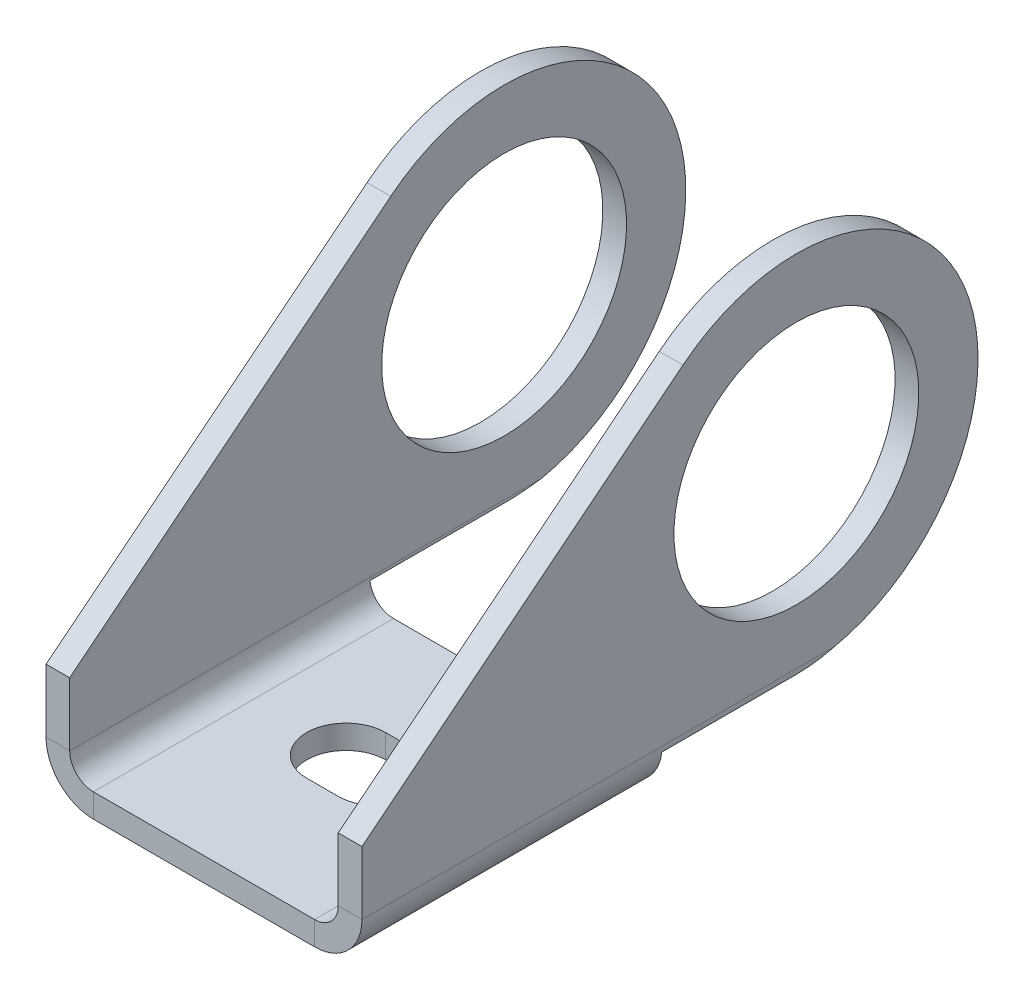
ISO-10303-21;
HEADER;
FILE_DESCRIPTION(('STEP AP214'),'2;1');
FILE_NAME('part.step','',(''),(''),'','','');
FILE_SCHEMA(('AUTOMOTIVE_DESIGN { 1 0 10303 214 1 1 1 1 }'));
ENDSEC;
DATA;
#1=APPLICATION_CONTEXT('core data for automotive mechanical design processes');
#2=APPLICATION_PROTOCOL_DEFINITION('international standard','automotive_design',2000,#1);
#3=PRODUCT_CONTEXT('',#1,'mechanical');
#4=PRODUCT('Part','Part','',(#3));
#5=PRODUCT_RELATED_PRODUCT_CATEGORY('part','',(#4));
#6=PRODUCT_DEFINITION_FORMATION('','',#4);
#7=PRODUCT_DEFINITION_CONTEXT('part definition',#1,'design');
#8=PRODUCT_DEFINITION('design','',#6,#7);
#9=PRODUCT_DEFINITION_SHAPE('','',#8);
#10=(LENGTH_UNIT() NAMED_UNIT(*) SI_UNIT(.MILLI.,.METRE.));
#11=(NAMED_UNIT(*) PLANE_ANGLE_UNIT() SI_UNIT($,.RADIAN.));
#12=(NAMED_UNIT(*) SI_UNIT($,.STERADIAN.) SOLID_ANGLE_UNIT());
#13=UNCERTAINTY_MEASURE_WITH_UNIT(LENGTH_MEASURE(1.E-05),#10,'distance_accuracy_value','');
#14=(GEOMETRIC_REPRESENTATION_CONTEXT(3) GLOBAL_UNCERTAINTY_ASSIGNED_CONTEXT((#13)) GLOBAL_UNIT_ASSIGNED_CONTEXT((#10,
#11,#12)) REPRESENTATION_CONTEXT('',''));
#15=CARTESIAN_POINT('',(0.,0.,0.));
#16=DIRECTION('',(0.,0.,1.));
#17=DIRECTION('',(1.,0.,0.));
#18=AXIS2_PLACEMENT_3D('',#15,#16,#17);
#19=CARTESIAN_POINT('',(160.601771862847,50.,78.));
#20=DIRECTION('',(0.,0.,-1.));
#21=DIRECTION('',(0.,1.,0.));
#22=AXIS2_PLACEMENT_3D('',#19,#20,#21);
#23=PLANE('',#22);
#24=DIRECTION('',(0.,-1.,0.));
#25=VECTOR('',#24,1.);
#26=CARTESIAN_POINT('',(-17.,50.,78.));
#27=LINE('',#26,#25);
#28=CARTESIAN_POINT('',(-17.,12.5,78.));
#29=VERTEX_POINT('',#28);
#30=CARTESIAN_POINT('',(-17.,4.49999999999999,78.));
#31=VERTEX_POINT('',#30);
#32=EDGE_CURVE('E50',#29,#31,#27,.T.);
#33=ORIENTED_EDGE('',*,*,#32,.F.);
#34=DIRECTION('',(1.,0.,0.));
#35=VECTOR('',#34,1.);
#36=CARTESIAN_POINT('',(-20.,12.5,78.));
#37=LINE('',#36,#35);
#38=CARTESIAN_POINT('',(-20.,12.5,78.));
#39=VERTEX_POINT('',#38);
#40=EDGE_CURVE('E531',#39,#29,#37,.T.);
#41=ORIENTED_EDGE('',*,*,#40,.F.);
#42=DIRECTION('',(0.,-1.,0.));
#43=VECTOR('',#42,1.);
#44=CARTESIAN_POINT('',(-20.,50.,78.));
#45=LINE('',#44,#43);
#46=CARTESIAN_POINT('',(-20.,4.5,78.));
#47=VERTEX_POINT('',#46);
#48=EDGE_CURVE('E57',#39,#47,#45,.T.);
#49=ORIENTED_EDGE('',*,*,#48,.T.);
#50=DIRECTION('',(-1.,0.,0.));
#51=VECTOR('',#50,1.);
#52=CARTESIAN_POINT('',(160.601771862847,4.50000000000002,78.));
#53=LINE('',#52,#51);
#54=EDGE_CURVE('E43',#31,#47,#53,.T.);
#55=ORIENTED_EDGE('',*,*,#54,.F.);
#56=EDGE_LOOP('',(#33,#41,#49,#55));
#57=FACE_BOUND('',#56,.T.);
#58=ADVANCED_FACE('F35',(#57),#23,.F.);
#59=CARTESIAN_POINT('',(-17.,50.,78.));
#60=DIRECTION('',(1.,0.,0.));
#61=DIRECTION('',(0.,1.,0.));
#62=AXIS2_PLACEMENT_3D('',#59,#60,#61);
#63=PLANE('',#62);
#64=CARTESIAN_POINT('',(-17.,27.,23.));
#65=DIRECTION('',(1.,0.,0.));
#66=DIRECTION('',(0.,-1.,0.));
#67=AXIS2_PLACEMENT_3D('',#64,#65,#66);
#68=CIRCLE('',#67,15.5);
#69=CARTESIAN_POINT('',(-17.,42.5,23.));
#70=VERTEX_POINT('',#69);
#71=EDGE_CURVE('E541',#70,#70,#68,.T.);
#72=ORIENTED_EDGE('',*,*,#71,.F.);
#73=EDGE_LOOP('',(#72));
#74=FACE_BOUND('',#73,.T.);
#75=CARTESIAN_POINT('',(-17.,27.,23.));
#76=DIRECTION('',(-1.,0.,0.));
#77=DIRECTION('',(0.,-1.,0.));
#78=AXIS2_PLACEMENT_3D('',#75,#76,#77);
#79=CIRCLE('',#78,23.);
#80=CARTESIAN_POINT('',(-17.,44.9698206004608,37.3556799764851));
#81=VERTEX_POINT('',#80);
#82=CARTESIAN_POINT('',(-17.,4.5,18.2303039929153));
#83=VERTEX_POINT('',#82);
#84=EDGE_CURVE('E539',#81,#83,#79,.T.);
#85=ORIENTED_EDGE('',*,*,#84,.F.);
#86=DIRECTION('',(0.,0.624159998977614,-0.781296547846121));
#87=VECTOR('',#86,1.);
#88=CARTESIAN_POINT('',(-17.,12.5,78.));
#89=LINE('',#88,#87);
#90=EDGE_CURVE('E519',#29,#81,#89,.T.);
#91=ORIENTED_EDGE('',*,*,#90,.F.);
#92=ORIENTED_EDGE('',*,*,#32,.T.);
#93=DIRECTION('',(0.,0.,1.));
#94=VECTOR('',#93,1.);
#95=CARTESIAN_POINT('',(-17.,4.5,0.));
#96=LINE('',#95,#94);
#97=EDGE_CURVE('E526',#83,#31,#96,.T.);
#98=ORIENTED_EDGE('',*,*,#97,.F.);
#99=EDGE_LOOP('',(#85,#91,#92,#98));
#100=FACE_BOUND('',#99,.T.);
#101=ADVANCED_FACE('F556',(#74,#100),#63,.T.);
#102=CARTESIAN_POINT('',(-20.,50.,78.));
#103=DIRECTION('',(1.,0.,0.));
#104=DIRECTION('',(0.,1.,0.));
#105=AXIS2_PLACEMENT_3D('',#102,#103,#104);
#106=PLANE('',#105);
#107=CARTESIAN_POINT('',(-20.,27.,23.));
#108=DIRECTION('',(1.,0.,0.));
#109=DIRECTION('',(0.,-1.,0.));
#110=AXIS2_PLACEMENT_3D('',#107,#108,#109);
#111=CIRCLE('',#110,15.5);
#112=CARTESIAN_POINT('',(-20.,42.5,23.));
#113=VERTEX_POINT('',#112);
#114=EDGE_CURVE('E546',#113,#113,#111,.T.);
#115=ORIENTED_EDGE('',*,*,#114,.T.);
#116=EDGE_LOOP('',(#115));
#117=FACE_BOUND('',#116,.T.);
#118=DIRECTION('',(0.,0.624159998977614,-0.781296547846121));
#119=VECTOR('',#118,1.);
#120=CARTESIAN_POINT('',(-20.,12.5,78.));
#121=LINE('',#120,#119);
#122=CARTESIAN_POINT('',(-20.,44.9698206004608,37.3556799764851));
#123=VERTEX_POINT('',#122);
#124=EDGE_CURVE('E518',#39,#123,#121,.T.);
#125=ORIENTED_EDGE('',*,*,#124,.T.);
#126=CARTESIAN_POINT('',(-20.,27.,23.));
#127=DIRECTION('',(-1.,0.,0.));
#128=DIRECTION('',(0.,-1.,0.));
#129=AXIS2_PLACEMENT_3D('',#126,#127,#128);
#130=CIRCLE('',#129,23.);
#131=CARTESIAN_POINT('',(-20.,4.5,18.2303039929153));
#132=VERTEX_POINT('',#131);
#133=EDGE_CURVE('E510',#123,#132,#130,.T.);
#134=ORIENTED_EDGE('',*,*,#133,.T.);
#135=DIRECTION('',(0.,0.,1.));
#136=VECTOR('',#135,1.);
#137=CARTESIAN_POINT('',(-20.,4.5,0.));
#138=LINE('',#137,#136);
#139=EDGE_CURVE('E521',#132,#47,#138,.T.);
#140=ORIENTED_EDGE('',*,*,#139,.T.);
#141=ORIENTED_EDGE('',*,*,#48,.F.);
#142=EDGE_LOOP('',(#125,#134,#140,#141));
#143=FACE_BOUND('',#142,.T.);
#144=ADVANCED_FACE('F502',(#117,#143),#106,.F.);
#145=CARTESIAN_POINT('',(-20.,27.,23.));
#146=DIRECTION('',(1.,0.,0.));
#147=DIRECTION('',(0.,1.,0.));
#148=AXIS2_PLACEMENT_3D('',#145,#146,#147);
#149=CYLINDRICAL_SURFACE('',#148,23.);
#150=CARTESIAN_POINT('',(-20.,4.5,18.2303039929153));
#151=CARTESIAN_POINT('',(-17.,4.5,18.2303039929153));
#152=B_SPLINE_CURVE_WITH_KNOTS('',1,(#150,#151),.UNSPECIFIED.,.F.,.F.,(2,2),(0.,1.),.UNSPECIFIED.);
#153=EDGE_CURVE('E12',#132,#83,#152,.T.);
#154=ORIENTED_EDGE('',*,*,#153,.F.);
#155=ORIENTED_EDGE('',*,*,#133,.F.);
#156=DIRECTION('',(1.,0.,0.));
#157=VECTOR('',#156,1.);
#158=CARTESIAN_POINT('',(-20.,44.9698206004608,37.3556799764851));
#159=LINE('',#158,#157);
#160=EDGE_CURVE('E528',#123,#81,#159,.T.);
#161=ORIENTED_EDGE('',*,*,#160,.T.);
#162=ORIENTED_EDGE('',*,*,#84,.T.);
#163=EDGE_LOOP('',(#154,#155,#161,#162));
#164=FACE_BOUND('',#163,.T.);
#165=ADVANCED_FACE('F497',(#164),#149,.T.);
#166=CARTESIAN_POINT('',(-20.,12.5,78.));
#167=DIRECTION('',(0.,-0.78129654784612,-0.624159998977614));
#168=DIRECTION('',(0.,0.624159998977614,-0.78129654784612));
#169=AXIS2_PLACEMENT_3D('',#166,#167,#168);
#170=PLANE('',#169);
#171=ORIENTED_EDGE('',*,*,#90,.T.);
#172=ORIENTED_EDGE('',*,*,#160,.F.);
#173=ORIENTED_EDGE('',*,*,#124,.F.);
#174=ORIENTED_EDGE('',*,*,#40,.T.);
#175=EDGE_LOOP('',(#171,#172,#173,#174));
#176=FACE_BOUND('',#175,.T.);
#177=ADVANCED_FACE('F493',(#176),#170,.F.);
#178=CARTESIAN_POINT('',(-20.,27.,23.));
#179=DIRECTION('',(1.,0.,0.));
#180=DIRECTION('',(0.,1.,0.));
#181=AXIS2_PLACEMENT_3D('',#178,#179,#180);
#182=CYLINDRICAL_SURFACE('',#181,15.5);
#183=CARTESIAN_POINT('',(-20.,42.5,23.));
#184=CARTESIAN_POINT('',(-19.96875,42.5,23.));
#185=CARTESIAN_POINT('',(-19.9375,42.5,23.));
#186=CARTESIAN_POINT('',(-19.875,42.5,23.));
#187=CARTESIAN_POINT('',(-19.84375,42.5,23.));
#188=CARTESIAN_POINT('',(-19.78125,42.5,23.));
#189=CARTESIAN_POINT('',(-19.75,42.5,23.));
#190=CARTESIAN_POINT('',(-19.6875,42.5,23.));
#191=CARTESIAN_POINT('',(-19.65625,42.5,23.));
#192=CARTESIAN_POINT('',(-19.59375,42.5,23.));
#193=CARTESIAN_POINT('',(-19.5625,42.5,23.));
#194=CARTESIAN_POINT('',(-19.5,42.5,23.));
#195=CARTESIAN_POINT('',(-19.46875,42.5,23.));
#196=CARTESIAN_POINT('',(-19.40625,42.5,23.));
#197=CARTESIAN_POINT('',(-19.375,42.5,23.));
#198=CARTESIAN_POINT('',(-19.3125,42.5,23.));
#199=CARTESIAN_POINT('',(-19.28125,42.5,23.));
#200=CARTESIAN_POINT('',(-19.21875,42.5,23.));
#201=CARTESIAN_POINT('',(-19.1875,42.5,23.));
#202=CARTESIAN_POINT('',(-19.125,42.5,23.));
#203=CARTESIAN_POINT('',(-19.09375,42.5,23.));
#204=CARTESIAN_POINT('',(-19.03125,42.5,23.));
#205=CARTESIAN_POINT('',(-19.,42.5,23.));
#206=CARTESIAN_POINT('',(-18.9375,42.5,23.));
#207=CARTESIAN_POINT('',(-18.90625,42.5,23.));
#208=CARTESIAN_POINT('',(-18.84375,42.5,23.));
#209=CARTESIAN_POINT('',(-18.8125,42.5,23.));
#210=CARTESIAN_POINT('',(-18.75,42.5,23.));
#211=CARTESIAN_POINT('',(-18.71875,42.5,23.));
#212=CARTESIAN_POINT('',(-18.65625,42.5,23.));
#213=CARTESIAN_POINT('',(-18.625,42.5,23.));
#214=CARTESIAN_POINT('',(-18.5625,42.5,23.));
#215=CARTESIAN_POINT('',(-18.53125,42.5,23.));
#216=CARTESIAN_POINT('',(-18.46875,42.5,23.));
#217=CARTESIAN_POINT('',(-18.4375,42.5,23.));
#218=CARTESIAN_POINT('',(-18.375,42.5,23.));
#219=CARTESIAN_POINT('',(-18.34375,42.5,23.));
#220=CARTESIAN_POINT('',(-18.28125,42.5,23.));
#221=CARTESIAN_POINT('',(-18.25,42.5,23.));
#222=CARTESIAN_POINT('',(-18.1875,42.5,23.));
#223=CARTESIAN_POINT('',(-18.15625,42.5,23.));
#224=CARTESIAN_POINT('',(-18.09375,42.5,23.));
#225=CARTESIAN_POINT('',(-18.0625,42.5,23.));
#226=CARTESIAN_POINT('',(-18.,42.5,23.));
#227=CARTESIAN_POINT('',(-17.96875,42.5,23.));
#228=CARTESIAN_POINT('',(-17.90625,42.5,23.));
#229=CARTESIAN_POINT('',(-17.875,42.5,23.));
#230=CARTESIAN_POINT('',(-17.8125,42.5,23.));
#231=CARTESIAN_POINT('',(-17.78125,42.5,23.));
#232=CARTESIAN_POINT('',(-17.71875,42.5,23.));
#233=CARTESIAN_POINT('',(-17.6875,42.5,23.));
#234=CARTESIAN_POINT('',(-17.625,42.5,23.));
#235=CARTESIAN_POINT('',(-17.59375,42.5,23.));
#236=CARTESIAN_POINT('',(-17.53125,42.5,23.));
#237=CARTESIAN_POINT('',(-17.5,42.5,23.));
#238=CARTESIAN_POINT('',(-17.4375,42.5,23.));
#239=CARTESIAN_POINT('',(-17.40625,42.5,23.));
#240=CARTESIAN_POINT('',(-17.34375,42.5,23.));
#241=CARTESIAN_POINT('',(-17.3125,42.5,23.));
#242=CARTESIAN_POINT('',(-17.25,42.5,23.));
#243=CARTESIAN_POINT('',(-17.21875,42.5,23.));
#244=CARTESIAN_POINT('',(-17.15625,42.5,23.));
#245=CARTESIAN_POINT('',(-17.125,42.5,23.));
#246=CARTESIAN_POINT('',(-17.0625,42.5,23.));
#247=CARTESIAN_POINT('',(-17.03125,42.5,23.));
#248=CARTESIAN_POINT('',(-17.,42.5,23.));
#249=B_SPLINE_CURVE_WITH_KNOTS('',3,(#183,#184,#185,#186,#187,#188,#189,#190,#191,#192,#193,
#194,#195,#196,#197,#198,#199,#200,#201,#202,#203,#204,#205,#206,#207,#208,#209,#210,#211,#212,
#213,#214,#215,#216,#217,#218,#219,#220,#221,#222,#223,#224,#225,#226,#227,#228,#229,#230,#231,
#232,#233,#234,#235,#236,#237,#238,#239,#240,#241,#242,#243,#244,#245,#246,#247,#248),
.UNSPECIFIED.,.F.,.F.,(4,2,2,2,2,2,2,2,2,2,2,2,2,2,2,2,2,2,2,2,2,2,2,2,2,2,2,2,2,2,2,2,4),(0.,
0.0937500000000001,0.1875,0.28125,0.375,0.46875,0.562500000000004,0.656250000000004,
0.750000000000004,0.843750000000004,0.937500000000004,1.03125,1.12500000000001,1.21875000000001,
1.31250000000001,1.40625000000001,1.50000000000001,1.59375000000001,1.68750000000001,
1.78125000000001,1.87500000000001,1.96875000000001,2.06250000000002,2.15625000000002,
2.25000000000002,2.34375000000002,2.43750000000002,2.53125000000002,2.62500000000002,
2.71875000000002,2.81250000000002,2.90625000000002,3.00000000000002),.UNSPECIFIED.);
#250=EDGE_CURVE('BSEAM489',#113,#70,#249,.T.);
#251=ORIENTED_EDGE('',*,*,#114,.F.);
#252=ORIENTED_EDGE('',*,*,#71,.T.);
#253=ORIENTED_EDGE('',*,*,#250,.T.);
#254=ORIENTED_EDGE('',*,*,#250,.F.);
#255=EDGE_LOOP('',(#251,#253,#252,#254));
#256=FACE_BOUND('',#255,.T.);
#257=ADVANCED_FACE('F489',(#256),#182,.F.);
#258=CARTESIAN_POINT('',(-160.601771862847,0.,78.));
#259=DIRECTION('',(0.,0.,-1.));
#260=DIRECTION('',(0.,-1.,0.));
#261=AXIS2_PLACEMENT_3D('',#258,#259,#260);
#262=PLANE('',#261);
#263=DIRECTION('',(0.,1.,0.));
#264=VECTOR('',#263,1.);
#265=CARTESIAN_POINT('',(20.,0.,78.));
#266=LINE('',#265,#264);
#267=CARTESIAN_POINT('',(20.,4.50000000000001,78.));
#268=VERTEX_POINT('',#267);
#269=CARTESIAN_POINT('',(20.,12.5,78.));
#270=VERTEX_POINT('',#269);
#271=EDGE_CURVE('E436',#268,#270,#266,.T.);
#272=ORIENTED_EDGE('',*,*,#271,.T.);
#273=DIRECTION('',(-1.,0.,0.));
#274=VECTOR('',#273,1.);
#275=CARTESIAN_POINT('',(20.,12.5,78.));
#276=LINE('',#275,#274);
#277=CARTESIAN_POINT('',(17.,12.5,78.));
#278=VERTEX_POINT('',#277);
#279=EDGE_CURVE('E433',#270,#278,#276,.T.);
#280=ORIENTED_EDGE('',*,*,#279,.T.);
#281=DIRECTION('',(0.,1.,0.));
#282=VECTOR('',#281,1.);
#283=CARTESIAN_POINT('',(17.,0.,78.));
#284=LINE('',#283,#282);
#285=CARTESIAN_POINT('',(17.,4.49999999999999,78.));
#286=VERTEX_POINT('',#285);
#287=EDGE_CURVE('E442',#286,#278,#284,.T.);
#288=ORIENTED_EDGE('',*,*,#287,.F.);
#289=DIRECTION('',(1.,0.,0.));
#290=VECTOR('',#289,1.);
#291=CARTESIAN_POINT('',(-160.601771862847,4.49999999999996,78.));
#292=LINE('',#291,#290);
#293=EDGE_CURVE('E446',#286,#268,#292,.T.);
#294=ORIENTED_EDGE('',*,*,#293,.T.);
#295=EDGE_LOOP('',(#272,#280,#288,#294));
#296=FACE_BOUND('',#295,.T.);
#297=ADVANCED_FACE('F485',(#296),#262,.F.);
#298=CARTESIAN_POINT('',(17.,0.,78.));
#299=DIRECTION('',(-1.,0.,0.));
#300=DIRECTION('',(0.,-1.,0.));
#301=AXIS2_PLACEMENT_3D('',#298,#299,#300);
#302=PLANE('',#301);
#303=CARTESIAN_POINT('',(17.,27.,23.));
#304=DIRECTION('',(-1.,0.,0.));
#305=DIRECTION('',(0.,-1.,0.));
#306=AXIS2_PLACEMENT_3D('',#303,#304,#305);
#307=CIRCLE('',#306,15.5);
#308=CARTESIAN_POINT('',(17.,11.5,23.));
#309=VERTEX_POINT('',#308);
#310=EDGE_CURVE('E422',#309,#309,#307,.T.);
#311=ORIENTED_EDGE('',*,*,#310,.F.);
#312=EDGE_LOOP('',(#311));
#313=FACE_BOUND('',#312,.T.);
#314=DIRECTION('',(0.,-0.624159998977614,0.781296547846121));
#315=VECTOR('',#314,1.);
#316=CARTESIAN_POINT('',(17.,12.5,78.));
#317=LINE('',#316,#315);
#318=CARTESIAN_POINT('',(17.,44.9698206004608,37.3556799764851));
#319=VERTEX_POINT('',#318);
#320=EDGE_CURVE('E426',#319,#278,#317,.T.);
#321=ORIENTED_EDGE('',*,*,#320,.F.);
#322=CARTESIAN_POINT('',(17.,27.,23.));
#323=DIRECTION('',(1.,0.,0.));
#324=DIRECTION('',(0.,-1.,0.));
#325=AXIS2_PLACEMENT_3D('',#322,#323,#324);
#326=CIRCLE('',#325,23.);
#327=CARTESIAN_POINT('',(17.,4.50000000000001,18.2303039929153));
#328=VERTEX_POINT('',#327);
#329=EDGE_CURVE('E425',#328,#319,#326,.T.);
#330=ORIENTED_EDGE('',*,*,#329,.F.);
#331=DIRECTION('',(0.,0.,-1.));
#332=VECTOR('',#331,1.);
#333=CARTESIAN_POINT('',(17.,4.50000000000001,78.));
#334=LINE('',#333,#332);
#335=EDGE_CURVE('E445',#286,#328,#334,.T.);
#336=ORIENTED_EDGE('',*,*,#335,.F.);
#337=ORIENTED_EDGE('',*,*,#287,.T.);
#338=EDGE_LOOP('',(#321,#330,#336,#337));
#339=FACE_BOUND('',#338,.T.);
#340=ADVANCED_FACE('F481',(#313,#339),#302,.T.);
#341=CARTESIAN_POINT('',(20.,0.,78.));
#342=DIRECTION('',(-1.,0.,0.));
#343=DIRECTION('',(0.,-1.,0.));
#344=AXIS2_PLACEMENT_3D('',#341,#342,#343);
#345=PLANE('',#344);
#346=CARTESIAN_POINT('',(20.,27.,23.));
#347=DIRECTION('',(-1.,0.,0.));
#348=DIRECTION('',(0.,-1.,0.));
#349=AXIS2_PLACEMENT_3D('',#346,#347,#348);
#350=CIRCLE('',#349,15.5);
#351=CARTESIAN_POINT('',(20.,11.5,23.));
#352=VERTEX_POINT('',#351);
#353=EDGE_CURVE('E419',#352,#352,#350,.T.);
#354=ORIENTED_EDGE('',*,*,#353,.T.);
#355=EDGE_LOOP('',(#354));
#356=FACE_BOUND('',#355,.T.);
#357=CARTESIAN_POINT('',(20.,27.,23.));
#358=DIRECTION('',(1.,0.,0.));
#359=DIRECTION('',(0.,-1.,0.));
#360=AXIS2_PLACEMENT_3D('',#357,#358,#359);
#361=CIRCLE('',#360,23.);
#362=CARTESIAN_POINT('',(20.,4.50000000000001,18.2303039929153));
#363=VERTEX_POINT('',#362);
#364=CARTESIAN_POINT('',(20.,44.9698206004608,37.3556799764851));
#365=VERTEX_POINT('',#364);
#366=EDGE_CURVE('E428',#363,#365,#361,.T.);
#367=ORIENTED_EDGE('',*,*,#366,.T.);
#368=DIRECTION('',(0.,-0.624159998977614,0.781296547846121));
#369=VECTOR('',#368,1.);
#370=CARTESIAN_POINT('',(20.,12.5,78.));
#371=LINE('',#370,#369);
#372=EDGE_CURVE('E429',#365,#270,#371,.T.);
#373=ORIENTED_EDGE('',*,*,#372,.T.);
#374=ORIENTED_EDGE('',*,*,#271,.F.);
#375=DIRECTION('',(0.,0.,-1.));
#376=VECTOR('',#375,1.);
#377=CARTESIAN_POINT('',(20.,4.50000000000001,78.));
#378=LINE('',#377,#376);
#379=EDGE_CURVE('E441',#268,#363,#378,.T.);
#380=ORIENTED_EDGE('',*,*,#379,.T.);
#381=EDGE_LOOP('',(#367,#373,#374,#380));
#382=FACE_BOUND('',#381,.T.);
#383=ADVANCED_FACE('F477',(#356,#382),#345,.F.);
#384=CARTESIAN_POINT('',(20.,27.,23.));
#385=DIRECTION('',(-1.,0.,0.));
#386=DIRECTION('',(0.,-1.,0.));
#387=AXIS2_PLACEMENT_3D('',#384,#385,#386);
#388=CYLINDRICAL_SURFACE('',#387,23.);
#389=CARTESIAN_POINT('',(17.,4.50000000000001,18.2303039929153));
#390=CARTESIAN_POINT('',(20.,4.50000000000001,18.2303039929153));
#391=B_SPLINE_CURVE_WITH_KNOTS('',1,(#389,#390),.UNSPECIFIED.,.F.,.F.,(2,2),(0.,1.),.UNSPECIFIED.);
#392=EDGE_CURVE('E449',#328,#363,#391,.T.);
#393=ORIENTED_EDGE('',*,*,#392,.F.);
#394=ORIENTED_EDGE('',*,*,#329,.T.);
#395=DIRECTION('',(-1.,0.,0.));
#396=VECTOR('',#395,1.);
#397=CARTESIAN_POINT('',(20.,44.9698206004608,37.3556799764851));
#398=LINE('',#397,#396);
#399=EDGE_CURVE('E432',#365,#319,#398,.T.);
#400=ORIENTED_EDGE('',*,*,#399,.F.);
#401=ORIENTED_EDGE('',*,*,#366,.F.);
#402=EDGE_LOOP('',(#393,#394,#400,#401));
#403=FACE_BOUND('',#402,.T.);
#404=ADVANCED_FACE('F466',(#403),#388,.T.);
#405=CARTESIAN_POINT('',(20.,12.5,78.));
#406=DIRECTION('',(0.,-0.78129654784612,-0.624159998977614));
#407=DIRECTION('',(0.,-0.624159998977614,0.78129654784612));
#408=AXIS2_PLACEMENT_3D('',#405,#406,#407);
#409=PLANE('',#408);
#410=ORIENTED_EDGE('',*,*,#320,.T.);
#411=ORIENTED_EDGE('',*,*,#279,.F.);
#412=ORIENTED_EDGE('',*,*,#372,.F.);
#413=ORIENTED_EDGE('',*,*,#399,.T.);
#414=EDGE_LOOP('',(#410,#411,#412,#413));
#415=FACE_BOUND('',#414,.T.);
#416=ADVANCED_FACE('F476',(#415),#409,.F.);
#417=CARTESIAN_POINT('',(20.,27.,23.));
#418=DIRECTION('',(-1.,0.,0.));
#419=DIRECTION('',(0.,-1.,0.));
#420=AXIS2_PLACEMENT_3D('',#417,#418,#419);
#421=CYLINDRICAL_SURFACE('',#420,15.5);
#422=CARTESIAN_POINT('',(20.,11.5,23.));
#423=CARTESIAN_POINT('',(19.96875,11.5,23.));
#424=CARTESIAN_POINT('',(19.9375,11.5,23.));
#425=CARTESIAN_POINT('',(19.875,11.5,23.));
#426=CARTESIAN_POINT('',(19.84375,11.5,23.));
#427=CARTESIAN_POINT('',(19.78125,11.5,23.));
#428=CARTESIAN_POINT('',(19.75,11.5,23.));
#429=CARTESIAN_POINT('',(19.6875,11.5,23.));
#430=CARTESIAN_POINT('',(19.65625,11.5,23.));
#431=CARTESIAN_POINT('',(19.59375,11.5,23.));
#432=CARTESIAN_POINT('',(19.5625,11.5,23.));
#433=CARTESIAN_POINT('',(19.5,11.5,23.));
#434=CARTESIAN_POINT('',(19.46875,11.5,23.));
#435=CARTESIAN_POINT('',(19.40625,11.5,23.));
#436=CARTESIAN_POINT('',(19.375,11.5,23.));
#437=CARTESIAN_POINT('',(19.3125,11.5,23.));
#438=CARTESIAN_POINT('',(19.28125,11.5,23.));
#439=CARTESIAN_POINT('',(19.21875,11.5,23.));
#440=CARTESIAN_POINT('',(19.1875,11.5,23.));
#441=CARTESIAN_POINT('',(19.125,11.5,23.));
#442=CARTESIAN_POINT('',(19.09375,11.5,23.));
#443=CARTESIAN_POINT('',(19.03125,11.5,23.));
#444=CARTESIAN_POINT('',(19.,11.5,23.));
#445=CARTESIAN_POINT('',(18.9375,11.5,23.));
#446=CARTESIAN_POINT('',(18.90625,11.5,23.));
#447=CARTESIAN_POINT('',(18.84375,11.5,23.));
#448=CARTESIAN_POINT('',(18.8125,11.5,23.));
#449=CARTESIAN_POINT('',(18.75,11.5,23.));
#450=CARTESIAN_POINT('',(18.71875,11.5,23.));
#451=CARTESIAN_POINT('',(18.65625,11.5,23.));
#452=CARTESIAN_POINT('',(18.625,11.5,23.));
#453=CARTESIAN_POINT('',(18.5625,11.5,23.));
#454=CARTESIAN_POINT('',(18.53125,11.5,23.));
#455=CARTESIAN_POINT('',(18.46875,11.5,23.));
#456=CARTESIAN_POINT('',(18.4375,11.5,23.));
#457=CARTESIAN_POINT('',(18.375,11.5,23.));
#458=CARTESIAN_POINT('',(18.34375,11.5,23.));
#459=CARTESIAN_POINT('',(18.28125,11.5,23.));
#460=CARTESIAN_POINT('',(18.25,11.5,23.));
#461=CARTESIAN_POINT('',(18.1875,11.5,23.));
#462=CARTESIAN_POINT('',(18.15625,11.5,23.));
#463=CARTESIAN_POINT('',(18.09375,11.5,23.));
#464=CARTESIAN_POINT('',(18.0625,11.5,23.));
#465=CARTESIAN_POINT('',(18.,11.5,23.));
#466=CARTESIAN_POINT('',(17.96875,11.5,23.));
#467=CARTESIAN_POINT('',(17.90625,11.5,23.));
#468=CARTESIAN_POINT('',(17.875,11.5,23.));
#469=CARTESIAN_POINT('',(17.8125,11.5,23.));
#470=CARTESIAN_POINT('',(17.78125,11.5,23.));
#471=CARTESIAN_POINT('',(17.71875,11.5,23.));
#472=CARTESIAN_POINT('',(17.6875,11.5,23.));
#473=CARTESIAN_POINT('',(17.625,11.5,23.));
#474=CARTESIAN_POINT('',(17.59375,11.5,23.));
#475=CARTESIAN_POINT('',(17.53125,11.5,23.));
#476=CARTESIAN_POINT('',(17.5,11.5,23.));
#477=CARTESIAN_POINT('',(17.4375,11.5,23.));
#478=CARTESIAN_POINT('',(17.40625,11.5,23.));
#479=CARTESIAN_POINT('',(17.34375,11.5,23.));
#480=CARTESIAN_POINT('',(17.3125,11.5,23.));
#481=CARTESIAN_POINT('',(17.25,11.5,23.));
#482=CARTESIAN_POINT('',(17.21875,11.5,23.));
#483=CARTESIAN_POINT('',(17.15625,11.5,23.));
#484=CARTESIAN_POINT('',(17.125,11.5,23.));
#485=CARTESIAN_POINT('',(17.0625,11.5,23.));
#486=CARTESIAN_POINT('',(17.03125,11.5,23.));
#487=CARTESIAN_POINT('',(17.,11.5,23.));
#488=B_SPLINE_CURVE_WITH_KNOTS('',3,(#422,#423,#424,#425,#426,#427,#428,#429,#430,#431,#432,
#433,#434,#435,#436,#437,#438,#439,#440,#441,#442,#443,#444,#445,#446,#447,#448,#449,#450,#451,
#452,#453,#454,#455,#456,#457,#458,#459,#460,#461,#462,#463,#464,#465,#466,#467,#468,#469,#470,
#471,#472,#473,#474,#475,#476,#477,#478,#479,#480,#481,#482,#483,#484,#485,#486,#487),
.UNSPECIFIED.,.F.,.F.,(4,2,2,2,2,2,2,2,2,2,2,2,2,2,2,2,2,2,2,2,2,2,2,2,2,2,2,2,2,2,2,2,4),(0.,
0.0937500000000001,0.1875,0.28125,0.375,0.46875,0.5625,0.656250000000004,0.750000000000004,
0.843750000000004,0.937500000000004,1.03125,1.125,1.21875000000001,1.31250000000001,
1.40625000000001,1.50000000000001,1.59375000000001,1.68750000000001,1.78125000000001,
1.87500000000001,1.96875000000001,2.06250000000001,2.15625000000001,2.25000000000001,
2.34375000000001,2.43750000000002,2.53125000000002,2.62500000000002,2.71875000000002,
2.81250000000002,2.90625000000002,3.00000000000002),.UNSPECIFIED.);
#489=EDGE_CURVE('BSEAM645',#352,#309,#488,.T.);
#490=ORIENTED_EDGE('',*,*,#353,.F.);
#491=ORIENTED_EDGE('',*,*,#310,.T.);
#492=ORIENTED_EDGE('',*,*,#489,.T.);
#493=ORIENTED_EDGE('',*,*,#489,.F.);
#494=EDGE_LOOP('',(#490,#492,#491,#493));
#495=FACE_BOUND('',#494,.T.);
#496=ADVANCED_FACE('F645',(#495),#421,.F.);
#497=CARTESIAN_POINT('',(20.568583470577,-1.50000000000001,40.));
#498=DIRECTION('',(0.,0.,1.));
#499=DIRECTION('',(1.,0.,0.));
#500=AXIS2_PLACEMENT_3D('',#497,#498,#499);
#501=PLANE('',#500);
#502=DIRECTION('',(1.,0.,0.));
#503=VECTOR('',#502,1.);
#504=CARTESIAN_POINT('',(20.568583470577,-1.50000000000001,40.));
#505=LINE('',#504,#503);
#506=CARTESIAN_POINT('',(-14.,-1.5,40.));
#507=VERTEX_POINT('',#506);
#508=CARTESIAN_POINT('',(14.,-1.50000000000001,40.));
#509=VERTEX_POINT('',#508);
#510=EDGE_CURVE('E387',#507,#509,#505,.T.);
#511=ORIENTED_EDGE('',*,*,#510,.F.);
#512=DIRECTION('',(0.,1.,0.));
#513=VECTOR('',#512,1.);
#514=CARTESIAN_POINT('',(-14.,-1.50000000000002,40.));
#515=LINE('',#514,#513);
#516=CARTESIAN_POINT('',(-14.,1.5,40.));
#517=VERTEX_POINT('',#516);
#518=EDGE_CURVE('E416',#507,#517,#515,.T.);
#519=ORIENTED_EDGE('',*,*,#518,.T.);
#520=DIRECTION('',(1.,0.,0.));
#521=VECTOR('',#520,1.);
#522=CARTESIAN_POINT('',(20.568583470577,1.50000000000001,40.));
#523=LINE('',#522,#521);
#524=CARTESIAN_POINT('',(14.,1.50000000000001,40.));
#525=VERTEX_POINT('',#524);
#526=EDGE_CURVE('E377',#517,#525,#523,.T.);
#527=ORIENTED_EDGE('',*,*,#526,.T.);
#528=DIRECTION('',(0.,-1.,0.));
#529=VECTOR('',#528,1.);
#530=CARTESIAN_POINT('',(14.,-1.50000000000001,40.));
#531=LINE('',#530,#529);
#532=EDGE_CURVE('E413',#525,#509,#531,.T.);
#533=ORIENTED_EDGE('',*,*,#532,.T.);
#534=EDGE_LOOP('',(#511,#519,#527,#533));
#535=FACE_BOUND('',#534,.T.);
#536=ADVANCED_FACE('F602',(#535),#501,.F.);
#537=CARTESIAN_POINT('',(-18.5,164.246794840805,78.));
#538=DIRECTION('',(0.,0.,-1.));
#539=DIRECTION('',(-1.,0.,0.));
#540=AXIS2_PLACEMENT_3D('',#537,#538,#539);
#541=PLANE('',#540);
#542=DIRECTION('',(0.,-1.,0.));
#543=VECTOR('',#542,1.);
#544=CARTESIAN_POINT('',(-14.,164.246794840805,78.));
#545=LINE('',#544,#543);
#546=CARTESIAN_POINT('',(-14.,1.5,78.));
#547=VERTEX_POINT('',#546);
#548=CARTESIAN_POINT('',(-14.,-1.5,78.));
#549=VERTEX_POINT('',#548);
#550=EDGE_CURVE('E404',#547,#549,#545,.T.);
#551=ORIENTED_EDGE('',*,*,#550,.T.);
#552=DIRECTION('',(1.,0.,0.));
#553=VECTOR('',#552,1.);
#554=CARTESIAN_POINT('',(-18.5,-1.5,78.));
#555=LINE('',#554,#553);
#556=CARTESIAN_POINT('',(14.,-1.49999999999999,78.));
#557=VERTEX_POINT('',#556);
#558=EDGE_CURVE('E390',#549,#557,#555,.T.);
#559=ORIENTED_EDGE('',*,*,#558,.T.);
#560=DIRECTION('',(0.,-1.,0.));
#561=VECTOR('',#560,1.);
#562=CARTESIAN_POINT('',(14.,164.246794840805,78.));
#563=LINE('',#562,#561);
#564=CARTESIAN_POINT('',(14.,1.50000000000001,78.));
#565=VERTEX_POINT('',#564);
#566=EDGE_CURVE('E402',#565,#557,#563,.T.);
#567=ORIENTED_EDGE('',*,*,#566,.F.);
#568=DIRECTION('',(1.,0.,0.));
#569=VECTOR('',#568,1.);
#570=CARTESIAN_POINT('',(-18.5,1.5,78.));
#571=LINE('',#570,#569);
#572=EDGE_CURVE('E396',#547,#565,#571,.T.);
#573=ORIENTED_EDGE('',*,*,#572,.F.);
#574=EDGE_LOOP('',(#551,#559,#567,#573));
#575=FACE_BOUND('',#574,.T.);
#576=ADVANCED_FACE('F615',(#575),#541,.F.);
#577=CARTESIAN_POINT('',(-18.5,1.5,78.));
#578=DIRECTION('',(0.,1.,0.));
#579=DIRECTION('',(-1.,0.,0.));
#580=AXIS2_PLACEMENT_3D('',#577,#578,#579);
#581=PLANE('',#580);
#582=CARTESIAN_POINT('',(2.,1.5,58.));
#583=DIRECTION('',(0.,1.,0.));
#584=DIRECTION('',(-1.,0.,0.));
#585=AXIS2_PLACEMENT_3D('',#582,#583,#584);
#586=CIRCLE('',#585,5.);
#587=CARTESIAN_POINT('',(2.,1.5,63.));
#588=VERTEX_POINT('',#587);
#589=CARTESIAN_POINT('',(2.,1.5,53.));
#590=VERTEX_POINT('',#589);
#591=EDGE_CURVE('E359',#588,#590,#586,.T.);
#592=ORIENTED_EDGE('',*,*,#591,.F.);
#593=DIRECTION('',(1.,0.,0.));
#594=VECTOR('',#593,1.);
#595=CARTESIAN_POINT('',(2.,1.5,63.));
#596=LINE('',#595,#594);
#597=CARTESIAN_POINT('',(-2.,1.5,63.));
#598=VERTEX_POINT('',#597);
#599=EDGE_CURVE('E374',#598,#588,#596,.T.);
#600=ORIENTED_EDGE('',*,*,#599,.F.);
#601=CARTESIAN_POINT('',(-2.,1.5,58.));
#602=DIRECTION('',(0.,1.,0.));
#603=DIRECTION('',(1.,0.,0.));
#604=AXIS2_PLACEMENT_3D('',#601,#602,#603);
#605=CIRCLE('',#604,5.);
#606=CARTESIAN_POINT('',(-2.,1.5,53.));
#607=VERTEX_POINT('',#606);
#608=EDGE_CURVE('E378',#607,#598,#605,.T.);
#609=ORIENTED_EDGE('',*,*,#608,.F.);
#610=DIRECTION('',(-1.,0.,0.));
#611=VECTOR('',#610,1.);
#612=CARTESIAN_POINT('',(2.,1.5,53.));
#613=LINE('',#612,#611);
#614=EDGE_CURVE('E381',#590,#607,#613,.T.);
#615=ORIENTED_EDGE('',*,*,#614,.F.);
#616=EDGE_LOOP('',(#592,#600,#609,#615));
#617=FACE_BOUND('',#616,.T.);
#618=ORIENTED_EDGE('',*,*,#526,.F.);
#619=DIRECTION('',(0.,0.,1.));
#620=VECTOR('',#619,1.);
#621=CARTESIAN_POINT('',(-14.,1.5,0.));
#622=LINE('',#621,#620);
#623=EDGE_CURVE('E399',#517,#547,#622,.T.);
#624=ORIENTED_EDGE('',*,*,#623,.T.);
#625=ORIENTED_EDGE('',*,*,#572,.T.);
#626=DIRECTION('',(0.,0.,-1.));
#627=VECTOR('',#626,1.);
#628=CARTESIAN_POINT('',(14.,1.5,78.));
#629=LINE('',#628,#627);
#630=EDGE_CURVE('E407',#565,#525,#629,.T.);
#631=ORIENTED_EDGE('',*,*,#630,.T.);
#632=EDGE_LOOP('',(#618,#624,#625,#631));
#633=FACE_BOUND('',#632,.T.);
#634=ADVANCED_FACE('F605',(#617,#633),#581,.T.);
#635=CARTESIAN_POINT('',(-18.5,-1.5,78.));
#636=DIRECTION('',(0.,1.,0.));
#637=DIRECTION('',(-1.,0.,0.));
#638=AXIS2_PLACEMENT_3D('',#635,#636,#637);
#639=PLANE('',#638);
#640=DIRECTION('',(1.,0.,0.));
#641=VECTOR('',#640,1.);
#642=CARTESIAN_POINT('',(2.,-1.50000000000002,63.));
#643=LINE('',#642,#641);
#644=CARTESIAN_POINT('',(-2.,-1.50000000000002,63.));
#645=VERTEX_POINT('',#644);
#646=CARTESIAN_POINT('',(2.,-1.50000000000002,63.));
#647=VERTEX_POINT('',#646);
#648=EDGE_CURVE('E356',#645,#647,#643,.T.);
#649=ORIENTED_EDGE('',*,*,#648,.T.);
#650=CARTESIAN_POINT('',(2.,-1.50000000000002,58.));
#651=DIRECTION('',(0.,1.,0.));
#652=DIRECTION('',(-1.,0.,0.));
#653=AXIS2_PLACEMENT_3D('',#650,#651,#652);
#654=CIRCLE('',#653,5.);
#655=CARTESIAN_POINT('',(2.,-1.50000000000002,53.));
#656=VERTEX_POINT('',#655);
#657=EDGE_CURVE('E352',#647,#656,#654,.T.);
#658=ORIENTED_EDGE('',*,*,#657,.T.);
#659=DIRECTION('',(-1.,0.,0.));
#660=VECTOR('',#659,1.);
#661=CARTESIAN_POINT('',(2.,-1.50000000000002,53.));
#662=LINE('',#661,#660);
#663=CARTESIAN_POINT('',(-2.,-1.5,53.));
#664=VERTEX_POINT('',#663);
#665=EDGE_CURVE('E360',#656,#664,#662,.T.);
#666=ORIENTED_EDGE('',*,*,#665,.T.);
#667=CARTESIAN_POINT('',(-2.,-1.50000000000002,58.));
#668=DIRECTION('',(0.,1.,0.));
#669=DIRECTION('',(1.,0.,0.));
#670=AXIS2_PLACEMENT_3D('',#667,#668,#669);
#671=CIRCLE('',#670,5.);
#672=EDGE_CURVE('E363',#664,#645,#671,.T.);
#673=ORIENTED_EDGE('',*,*,#672,.T.);
#674=EDGE_LOOP('',(#649,#658,#666,#673));
#675=FACE_BOUND('',#674,.T.);
#676=DIRECTION('',(0.,0.,1.));
#677=VECTOR('',#676,1.);
#678=CARTESIAN_POINT('',(-14.,-1.5,0.));
#679=LINE('',#678,#677);
#680=EDGE_CURVE('E393',#507,#549,#679,.T.);
#681=ORIENTED_EDGE('',*,*,#680,.F.);
#682=ORIENTED_EDGE('',*,*,#510,.T.);
#683=DIRECTION('',(0.,0.,-1.));
#684=VECTOR('',#683,1.);
#685=CARTESIAN_POINT('',(14.,-1.5,78.));
#686=LINE('',#685,#684);
#687=EDGE_CURVE('E410',#557,#509,#686,.T.);
#688=ORIENTED_EDGE('',*,*,#687,.F.);
#689=ORIENTED_EDGE('',*,*,#558,.F.);
#690=EDGE_LOOP('',(#681,#682,#688,#689));
#691=FACE_BOUND('',#690,.T.);
#692=ADVANCED_FACE('F619',(#675,#691),#639,.F.);
#693=CARTESIAN_POINT('',(2.,-1.50000000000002,58.));
#694=DIRECTION('',(0.,1.,0.));
#695=DIRECTION('',(-1.,0.,0.));
#696=AXIS2_PLACEMENT_3D('',#693,#694,#695);
#697=CYLINDRICAL_SURFACE('',#696,5.);
#698=ORIENTED_EDGE('',*,*,#591,.T.);
#699=DIRECTION('',(0.,1.,0.));
#700=VECTOR('',#699,1.);
#701=CARTESIAN_POINT('',(2.,-1.50000000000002,53.));
#702=LINE('',#701,#700);
#703=EDGE_CURVE('E353',#656,#590,#702,.T.);
#704=ORIENTED_EDGE('',*,*,#703,.F.);
#705=ORIENTED_EDGE('',*,*,#657,.F.);
#706=DIRECTION('',(0.,1.,0.));
#707=VECTOR('',#706,1.);
#708=CARTESIAN_POINT('',(2.,-1.50000000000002,63.));
#709=LINE('',#708,#707);
#710=EDGE_CURVE('E364',#647,#588,#709,.T.);
#711=ORIENTED_EDGE('',*,*,#710,.T.);
#712=EDGE_LOOP('',(#698,#704,#705,#711));
#713=FACE_BOUND('',#712,.T.);
#714=ADVANCED_FACE('F734',(#713),#697,.F.);
#715=CARTESIAN_POINT('',(2.,-1.50000000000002,63.));
#716=DIRECTION('',(0.,0.,1.));
#717=DIRECTION('',(1.,0.,0.));
#718=AXIS2_PLACEMENT_3D('',#715,#716,#717);
#719=PLANE('',#718);
#720=ORIENTED_EDGE('',*,*,#599,.T.);
#721=ORIENTED_EDGE('',*,*,#710,.F.);
#722=ORIENTED_EDGE('',*,*,#648,.F.);
#723=DIRECTION('',(0.,1.,0.));
#724=VECTOR('',#723,1.);
#725=CARTESIAN_POINT('',(-2.,-1.50000000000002,63.));
#726=LINE('',#725,#724);
#727=EDGE_CURVE('E361',#645,#598,#726,.T.);
#728=ORIENTED_EDGE('',*,*,#727,.T.);
#729=EDGE_LOOP('',(#720,#721,#722,#728));
#730=FACE_BOUND('',#729,.T.);
#731=ADVANCED_FACE('F744',(#730),#719,.F.);
#732=CARTESIAN_POINT('',(-2.,-1.50000000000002,58.));
#733=DIRECTION('',(0.,1.,0.));
#734=DIRECTION('',(-1.,0.,0.));
#735=AXIS2_PLACEMENT_3D('',#732,#733,#734);
#736=CYLINDRICAL_SURFACE('',#735,5.);
#737=ORIENTED_EDGE('',*,*,#608,.T.);
#738=ORIENTED_EDGE('',*,*,#727,.F.);
#739=ORIENTED_EDGE('',*,*,#672,.F.);
#740=DIRECTION('',(0.,1.,0.));
#741=VECTOR('',#740,1.);
#742=CARTESIAN_POINT('',(-2.,-1.50000000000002,53.));
#743=LINE('',#742,#741);
#744=EDGE_CURVE('E357',#664,#607,#743,.T.);
#745=ORIENTED_EDGE('',*,*,#744,.T.);
#746=EDGE_LOOP('',(#737,#738,#739,#745));
#747=FACE_BOUND('',#746,.T.);
#748=ADVANCED_FACE('F754',(#747),#736,.F.);
#749=CARTESIAN_POINT('',(2.,-1.50000000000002,53.));
#750=DIRECTION('',(0.,0.,-1.));
#751=DIRECTION('',(-1.,0.,0.));
#752=AXIS2_PLACEMENT_3D('',#749,#750,#751);
#753=PLANE('',#752);
#754=ORIENTED_EDGE('',*,*,#614,.T.);
#755=ORIENTED_EDGE('',*,*,#744,.F.);
#756=ORIENTED_EDGE('',*,*,#665,.F.);
#757=ORIENTED_EDGE('',*,*,#703,.T.);
#758=EDGE_LOOP('',(#754,#755,#756,#757));
#759=FACE_BOUND('',#758,.T.);
#760=ADVANCED_FACE('F764',(#759),#753,.F.);
#761=CARTESIAN_POINT('',(14.,4.50000000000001,40.));
#762=DIRECTION('',(0.,0.,-1.));
#763=DIRECTION('',(-1.,0.,0.));
#764=AXIS2_PLACEMENT_3D('',#761,#762,#763);
#765=PLANE('',#764);
#766=ORIENTED_EDGE('',*,*,#532,.F.);
#767=CARTESIAN_POINT('',(14.,4.50000000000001,40.));
#768=DIRECTION('',(0.,0.,-1.));
#769=DIRECTION('',(-1.,0.,0.));
#770=AXIS2_PLACEMENT_3D('',#767,#768,#769);
#771=CIRCLE('',#770,3.);
#772=CARTESIAN_POINT('',(16.9815005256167,4.16735211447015,40.));
#773=VERTEX_POINT('',#772);
#774=EDGE_CURVE('E253',#525,#773,#771,.F.);
#775=ORIENTED_EDGE('',*,*,#774,.T.);
#776=DIRECTION('',(0.993833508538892,-0.110882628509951,0.));
#777=VECTOR('',#776,1.);
#778=CARTESIAN_POINT('',(18.472250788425,4.00102817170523,40.));
#779=LINE('',#778,#777);
#780=CARTESIAN_POINT('',(19.9630010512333,3.8347042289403,40.));
#781=VERTEX_POINT('',#780);
#782=EDGE_CURVE('E345',#773,#781,#779,.T.);
#783=ORIENTED_EDGE('',*,*,#782,.T.);
#784=CARTESIAN_POINT('',(14.,4.50000000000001,40.));
#785=DIRECTION('',(0.,0.,-1.));
#786=DIRECTION('',(-1.,0.,0.));
#787=AXIS2_PLACEMENT_3D('',#784,#785,#786);
#788=CIRCLE('',#787,6.);
#789=EDGE_CURVE('E261',#509,#781,#788,.F.);
#790=ORIENTED_EDGE('',*,*,#789,.F.);
#791=EDGE_LOOP('',(#766,#775,#783,#790));
#792=FACE_BOUND('',#791,.T.);
#793=ADVANCED_FACE('F622',(#792),#765,.T.);
#794=CARTESIAN_POINT('',(18.472250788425,4.00102817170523,31.5));
#795=DIRECTION('',(-0.110882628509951,-0.993833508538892,0.));
#796=DIRECTION('',(0.,0.,-1.));
#797=AXIS2_PLACEMENT_3D('',#794,#795,#796);
#798=PLANE('',#797);
#799=ORIENTED_EDGE('',*,*,#782,.F.);
#800=DIRECTION('',(0.,0.,-1.));
#801=VECTOR('',#800,1.);
#802=CARTESIAN_POINT('',(16.9815005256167,4.16735211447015,232.332450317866));
#803=LINE('',#802,#801);
#804=CARTESIAN_POINT('',(16.9815005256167,4.16735211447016,23.));
#805=VERTEX_POINT('',#804);
#806=EDGE_CURVE('E257',#773,#805,#803,.T.);
#807=ORIENTED_EDGE('',*,*,#806,.T.);
#808=CARTESIAN_POINT('',(19.9630010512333,3.83470422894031,23.));
#809=CARTESIAN_POINT('',(16.9815005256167,4.16735211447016,23.));
#810=B_SPLINE_CURVE_WITH_KNOTS('',1,(#808,#809),.UNSPECIFIED.,.F.,.F.,(2,2),(0.,1.),.UNSPECIFIED.);
#811=CARTESIAN_POINT('',(19.9630010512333,3.8347042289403,23.));
#812=VERTEX_POINT('',#811);
#813=EDGE_CURVE('E268',#805,#812,#810,.F.);
#814=ORIENTED_EDGE('',*,*,#813,.T.);
#815=DIRECTION('',(0.,0.,-1.));
#816=VECTOR('',#815,1.);
#817=CARTESIAN_POINT('',(19.9630010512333,3.8347042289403,232.332450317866));
#818=LINE('',#817,#816);
#819=EDGE_CURVE('E265',#781,#812,#818,.T.);
#820=ORIENTED_EDGE('',*,*,#819,.F.);
#821=EDGE_LOOP('',(#799,#807,#814,#820));
#822=FACE_BOUND('',#821,.T.);
#823=ADVANCED_FACE('F295',(#822),#798,.T.);
#824=CARTESIAN_POINT('',(19.9630010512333,3.83470422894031,23.));
#825=CARTESIAN_POINT('',(19.9631028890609,3.83561699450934,22.8720614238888));
#826=CARTESIAN_POINT('',(19.9632489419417,3.83692759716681,22.7580502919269));
#827=CARTESIAN_POINT('',(19.9635331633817,3.83949038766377,22.6079247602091));
#828=CARTESIAN_POINT('',(19.9636387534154,3.8404441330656,22.5613647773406));
#829=CARTESIAN_POINT('',(19.9638131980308,3.84202399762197,22.496747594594));
#830=CARTESIAN_POINT('',(19.9638740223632,3.84257549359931,22.4760789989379));
#831=CARTESIAN_POINT('',(19.9639692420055,3.84344005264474,22.4463818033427));
#832=CARTESIAN_POINT('',(19.9640016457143,3.84373445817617,22.4367003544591));
#833=CARTESIAN_POINT('',(19.9640677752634,3.84433570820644,22.4177726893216));
#834=CARTESIAN_POINT('',(19.9640891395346,3.84453000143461,22.4117723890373));
#835=CARTESIAN_POINT('',(19.9645098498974,3.84836054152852,22.3013017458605));
#836=CARTESIAN_POINT('',(19.9649807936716,3.8526734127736,22.202195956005));
#837=CARTESIAN_POINT('',(19.9661048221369,3.86311631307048,22.0021650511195));
#838=CARTESIAN_POINT('',(19.9667730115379,3.86939085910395,21.8991493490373));
#839=CARTESIAN_POINT('',(19.9689349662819,3.89007573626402,21.5999167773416));
#840=CARTESIAN_POINT('',(19.9706963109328,3.90736042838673,21.400395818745));
#841=CARTESIAN_POINT('',(19.974676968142,3.94893627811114,21.0012887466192));
#842=CARTESIAN_POINT('',(19.9769269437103,3.9735948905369,20.7990654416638));
#843=CARTESIAN_POINT('',(19.9883750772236,4.11077974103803,19.8141579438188));
#844=CARTESIAN_POINT('',(20.,4.27709479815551,19.0235807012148));
#845=CARTESIAN_POINT('',(20.,4.50000000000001,18.2303039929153));
#846=CARTESIAN_POINT('',(16.9815005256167,4.16735211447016,23.));
#847=CARTESIAN_POINT('',(16.9815514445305,4.16780849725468,22.8720614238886));
#848=CARTESIAN_POINT('',(16.9816244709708,4.16846379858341,22.7580502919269));
#849=CARTESIAN_POINT('',(16.9817665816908,4.16974519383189,22.6079247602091));
#850=CARTESIAN_POINT('',(16.9818193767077,4.1702220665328,22.5613647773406));
#851=CARTESIAN_POINT('',(16.9819065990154,4.17101199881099,22.496747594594));
#852=CARTESIAN_POINT('',(16.9819370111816,4.17128774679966,22.4760789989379));
#853=CARTESIAN_POINT('',(16.9819846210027,4.17172002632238,22.4463818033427));
#854=CARTESIAN_POINT('',(16.9820008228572,4.17186722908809,22.4367003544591));
#855=CARTESIAN_POINT('',(16.9820338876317,4.17216785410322,22.4177726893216));
#856=CARTESIAN_POINT('',(16.9820445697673,4.17226500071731,22.4117723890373));
#857=CARTESIAN_POINT('',(16.9822549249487,4.17418027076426,22.3013017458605));
#858=CARTESIAN_POINT('',(16.9824903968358,4.17633670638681,22.202195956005));
#859=CARTESIAN_POINT('',(16.9830524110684,4.18155815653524,22.0021650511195));
#860=CARTESIAN_POINT('',(16.983386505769,4.18469542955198,21.8991493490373));
#861=CARTESIAN_POINT('',(16.9844674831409,4.19503786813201,21.5999167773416));
#862=CARTESIAN_POINT('',(16.9853481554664,4.20368021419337,21.400395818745));
#863=CARTESIAN_POINT('',(16.987338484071,4.22446813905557,21.0012887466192));
#864=CARTESIAN_POINT('',(16.9884634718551,4.23679744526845,20.7990654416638));
#865=CARTESIAN_POINT('',(16.9941875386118,4.30538987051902,19.8141579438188));
#866=CARTESIAN_POINT('',(17.,4.38854906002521,19.0235688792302));
#867=CARTESIAN_POINT('',(17.,4.50000000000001,18.2303039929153));
#868=B_SPLINE_SURFACE_WITH_KNOTS('',1,3,((#824,#825,#826,#827,#828,#829,#830,#831,#832,#833,
#834,#835,#836,#837,#838,#839,#840,#841,#842,#843,#844,#845),(#846,#847,#848,#849,#850,#851,
#852,#853,#854,#855,#856,#857,#858,#859,#860,#861,#862,#863,#864,#865,#866,#867)),.UNSPECIFIED.,
.F.,.F.,.F.,(2,2),(4,2,2,2,2,2,2,2,2,2,4),(0.,1.),(0.,0.0625,0.09375,0.109375,0.1171875,0.125,
0.1875,0.25,0.375,0.5,1.),.UNSPECIFIED.);
#869=CARTESIAN_POINT('',(16.9815005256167,4.16735211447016,23.));
#870=CARTESIAN_POINT('',(16.9815514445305,4.16780849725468,22.8720614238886));
#871=CARTESIAN_POINT('',(16.9816244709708,4.16846379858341,22.7580502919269));
#872=CARTESIAN_POINT('',(16.9817665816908,4.16974519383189,22.6079247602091));
#873=CARTESIAN_POINT('',(16.9818193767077,4.1702220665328,22.5613647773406));
#874=CARTESIAN_POINT('',(16.9819065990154,4.17101199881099,22.496747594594));
#875=CARTESIAN_POINT('',(16.9819370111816,4.17128774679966,22.4760789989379));
#876=CARTESIAN_POINT('',(16.9819846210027,4.17172002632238,22.4463818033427));
#877=CARTESIAN_POINT('',(16.9820008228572,4.17186722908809,22.4367003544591));
#878=CARTESIAN_POINT('',(16.9820338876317,4.17216785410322,22.4177726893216));
#879=CARTESIAN_POINT('',(16.9820445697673,4.17226500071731,22.4117723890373));
#880=CARTESIAN_POINT('',(16.9822549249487,4.17418027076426,22.3013017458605));
#881=CARTESIAN_POINT('',(16.9824903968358,4.17633670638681,22.202195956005));
#882=CARTESIAN_POINT('',(16.9830524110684,4.18155815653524,22.0021650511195));
#883=CARTESIAN_POINT('',(16.983386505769,4.18469542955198,21.8991493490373));
#884=CARTESIAN_POINT('',(16.9844674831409,4.19503786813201,21.5999167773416));
#885=CARTESIAN_POINT('',(16.9853481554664,4.20368021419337,21.400395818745));
#886=CARTESIAN_POINT('',(16.987338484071,4.22446813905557,21.0012887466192));
#887=CARTESIAN_POINT('',(16.9884634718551,4.23679744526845,20.7990654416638));
#888=CARTESIAN_POINT('',(16.9941875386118,4.30538987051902,19.8141579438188));
#889=CARTESIAN_POINT('',(17.,4.38854906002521,19.0235688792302));
#890=CARTESIAN_POINT('',(17.,4.50000000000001,18.2303039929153));
#891=B_SPLINE_CURVE_WITH_KNOTS('',3,(#869,#870,#871,#872,#873,#874,#875,#876,#877,#878,#879,
#880,#881,#882,#883,#884,#885,#886,#887,#888,#889,#890),.UNSPECIFIED.,.F.,.F.,(4,2,2,2,2,2,2,2,
2,2,4),(0.,0.0625,0.09375,0.109375,0.1171875,0.125,0.1875,0.25,0.375,0.5,1.),.UNSPECIFIED.);
#892=EDGE_CURVE('E187',#805,#328,#891,.T.);
#893=CARTESIAN_POINT('',(20.,4.50000000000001,18.2303039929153));
#894=CARTESIAN_POINT('',(20.,4.27709479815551,19.0235807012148));
#895=CARTESIAN_POINT('',(19.9883750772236,4.11077974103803,19.8141579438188));
#896=CARTESIAN_POINT('',(19.9769269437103,3.9735948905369,20.7990654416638));
#897=CARTESIAN_POINT('',(19.974676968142,3.94893627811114,21.0012887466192));
#898=CARTESIAN_POINT('',(19.9706963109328,3.90736042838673,21.400395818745));
#899=CARTESIAN_POINT('',(19.9689349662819,3.89007573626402,21.5999167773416));
#900=CARTESIAN_POINT('',(19.9667730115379,3.86939085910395,21.8991493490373));
#901=CARTESIAN_POINT('',(19.9661048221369,3.86311631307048,22.0021650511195));
#902=CARTESIAN_POINT('',(19.9649807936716,3.8526734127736,22.202195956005));
#903=CARTESIAN_POINT('',(19.9645098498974,3.84836054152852,22.3013017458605));
#904=CARTESIAN_POINT('',(19.9640891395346,3.84453000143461,22.4117723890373));
#905=CARTESIAN_POINT('',(19.9640677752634,3.84433570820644,22.4177726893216));
#906=CARTESIAN_POINT('',(19.9640016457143,3.84373445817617,22.4367003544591));
#907=CARTESIAN_POINT('',(19.9639692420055,3.84344005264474,22.4463818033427));
#908=CARTESIAN_POINT('',(19.9638740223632,3.84257549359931,22.4760789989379));
#909=CARTESIAN_POINT('',(19.9638131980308,3.84202399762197,22.496747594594));
#910=CARTESIAN_POINT('',(19.9636387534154,3.8404441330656,22.5613647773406));
#911=CARTESIAN_POINT('',(19.9635331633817,3.83949038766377,22.6079247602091));
#912=CARTESIAN_POINT('',(19.9632489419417,3.83692759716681,22.7580502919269));
#913=CARTESIAN_POINT('',(19.9631028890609,3.83561699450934,22.8720614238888));
#914=CARTESIAN_POINT('',(19.9630010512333,3.83470422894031,23.));
#915=B_SPLINE_CURVE_WITH_KNOTS('',3,(#893,#894,#895,#896,#897,#898,#899,#900,#901,#902,#903,
#904,#905,#906,#907,#908,#909,#910,#911,#912,#913,#914),.UNSPECIFIED.,.F.,.F.,(4,2,2,2,2,2,2,2,
2,2,4),(0.,0.5,0.625,0.75,0.8125,0.875,0.8828125,0.890625,0.90625,0.9375,1.),.UNSPECIFIED.);
#916=EDGE_CURVE('E260',#812,#363,#915,.F.);
#917=ORIENTED_EDGE('',*,*,#813,.F.);
#918=ORIENTED_EDGE('',*,*,#892,.T.);
#919=ORIENTED_EDGE('',*,*,#392,.T.);
#920=ORIENTED_EDGE('',*,*,#916,.F.);
#921=EDGE_LOOP('',(#917,#918,#919,#920));
#922=FACE_BOUND('',#921,.T.);
#923=ADVANCED_FACE('F288',(#922),#868,.T.);
#924=CARTESIAN_POINT('',(14.,4.50000000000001,78.));
#925=DIRECTION('',(0.,0.,1.));
#926=DIRECTION('',(1.,0.,0.));
#927=AXIS2_PLACEMENT_3D('',#924,#925,#926);
#928=PLANE('',#927);
#929=CARTESIAN_POINT('',(14.,4.50000000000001,78.));
#930=DIRECTION('',(0.,0.,-1.));
#931=DIRECTION('',(-1.,0.,0.));
#932=AXIS2_PLACEMENT_3D('',#929,#930,#931);
#933=CIRCLE('',#932,3.);
#934=EDGE_CURVE('E256',#286,#565,#933,.T.);
#935=ORIENTED_EDGE('',*,*,#934,.T.);
#936=ORIENTED_EDGE('',*,*,#566,.T.);
#937=CARTESIAN_POINT('',(14.,4.50000000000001,78.));
#938=DIRECTION('',(0.,0.,-1.));
#939=DIRECTION('',(-1.,0.,0.));
#940=AXIS2_PLACEMENT_3D('',#937,#938,#939);
#941=CIRCLE('',#940,6.);
#942=EDGE_CURVE('E264',#268,#557,#941,.T.);
#943=ORIENTED_EDGE('',*,*,#942,.F.);
#944=ORIENTED_EDGE('',*,*,#293,.F.);
#945=EDGE_LOOP('',(#935,#936,#943,#944));
#946=FACE_BOUND('',#945,.T.);
#947=ADVANCED_FACE('F286',(#946),#928,.T.);
#948=CARTESIAN_POINT('',(14.,4.50000000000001,232.332450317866));
#949=DIRECTION('',(0.,0.,-1.));
#950=DIRECTION('',(-1.,0.,0.));
#951=AXIS2_PLACEMENT_3D('',#948,#949,#950);
#952=CYLINDRICAL_SURFACE('',#951,6.);
#953=ORIENTED_EDGE('',*,*,#379,.F.);
#954=ORIENTED_EDGE('',*,*,#942,.T.);
#955=ORIENTED_EDGE('',*,*,#687,.T.);
#956=ORIENTED_EDGE('',*,*,#789,.T.);
#957=ORIENTED_EDGE('',*,*,#819,.T.);
#958=ORIENTED_EDGE('',*,*,#916,.T.);
#959=EDGE_LOOP('',(#953,#954,#955,#956,#957,#958));
#960=FACE_BOUND('',#959,.T.);
#961=ADVANCED_FACE('F275',(#960),#952,.T.);
#962=CARTESIAN_POINT('',(14.,4.50000000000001,232.332450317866));
#963=DIRECTION('',(0.,0.,-1.));
#964=DIRECTION('',(-1.,0.,0.));
#965=AXIS2_PLACEMENT_3D('',#962,#963,#964);
#966=CYLINDRICAL_SURFACE('',#965,3.);
#967=ORIENTED_EDGE('',*,*,#335,.T.);
#968=ORIENTED_EDGE('',*,*,#892,.F.);
#969=ORIENTED_EDGE('',*,*,#806,.F.);
#970=ORIENTED_EDGE('',*,*,#774,.F.);
#971=ORIENTED_EDGE('',*,*,#630,.F.);
#972=ORIENTED_EDGE('',*,*,#934,.F.);
#973=EDGE_LOOP('',(#967,#968,#969,#970,#971,#972));
#974=FACE_BOUND('',#973,.T.);
#975=ADVANCED_FACE('F285',(#974),#966,.F.);
#976=CARTESIAN_POINT('',(-14.,4.5,78.));
#977=DIRECTION('',(0.,0.,1.));
#978=DIRECTION('',(1.,0.,0.));
#979=AXIS2_PLACEMENT_3D('',#976,#977,#978);
#980=PLANE('',#979);
#981=ORIENTED_EDGE('',*,*,#550,.F.);
#982=CARTESIAN_POINT('',(-14.,4.5,78.));
#983=DIRECTION('',(0.,0.,1.));
#984=DIRECTION('',(1.,0.,0.));
#985=AXIS2_PLACEMENT_3D('',#982,#983,#984);
#986=CIRCLE('',#985,3.);
#987=EDGE_CURVE('E203',#547,#31,#986,.F.);
#988=ORIENTED_EDGE('',*,*,#987,.T.);
#989=ORIENTED_EDGE('',*,*,#54,.T.);
#990=CARTESIAN_POINT('',(-14.,4.5,78.));
#991=DIRECTION('',(0.,0.,1.));
#992=DIRECTION('',(1.,0.,0.));
#993=AXIS2_PLACEMENT_3D('',#990,#991,#992);
#994=CIRCLE('',#993,6.);
#995=EDGE_CURVE('E564',#549,#47,#994,.F.);
#996=ORIENTED_EDGE('',*,*,#995,.F.);
#997=EDGE_LOOP('',(#981,#988,#989,#996));
#998=FACE_BOUND('',#997,.T.);
#999=ADVANCED_FACE('F223',(#998),#980,.T.);
#1000=CARTESIAN_POINT('',(-20.,4.5,18.2303039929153));
#1001=CARTESIAN_POINT('',(-20.,4.46552109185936,18.3556113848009));
#1002=CARTESIAN_POINT('',(-19.9997073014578,4.43528624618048,18.4673527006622));
#1003=CARTESIAN_POINT('',(-19.9991179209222,4.39630301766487,18.6146157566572));
#1004=CARTESIAN_POINT('',(-19.998895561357,4.3843700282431,18.6603119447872));
#1005=CARTESIAN_POINT('',(-19.9985516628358,4.36806247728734,18.7237689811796));
#1006=CARTESIAN_POINT('',(-19.9984352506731,4.36289194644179,18.7440734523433));
#1007=CARTESIAN_POINT('',(-19.9982610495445,4.35553408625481,18.7732583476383));
#1008=CARTESIAN_POINT('',(-19.9982030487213,4.3531477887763,18.7827746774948));
#1009=CARTESIAN_POINT('',(-19.9980876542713,4.34850783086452,18.8013834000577));
#1010=CARTESIAN_POINT('',(-19.9980507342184,4.34704168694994,18.807278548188));
#1011=CARTESIAN_POINT('',(-19.9973546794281,4.32026792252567,18.9159775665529));
#1012=CARTESIAN_POINT('',(-19.9966111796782,4.29711729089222,19.0136172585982));
#1013=CARTESIAN_POINT('',(-19.9949194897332,4.2521142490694,19.2109333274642));
#1014=CARTESIAN_POINT('',(-19.993950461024,4.22983258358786,19.3126482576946));
#1015=CARTESIAN_POINT('',(-19.9909249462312,4.16751159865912,19.6086167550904));
#1016=CARTESIAN_POINT('',(-19.9886448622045,4.12940566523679,19.8065046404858));
#1017=CARTESIAN_POINT('',(-19.9839507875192,4.06006771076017,20.203431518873));
#1018=CARTESIAN_POINT('',(-19.981506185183,4.02846868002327,20.4051039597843));
#1019=CARTESIAN_POINT('',(-19.9700580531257,3.89128388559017,21.3900094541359));
#1020=CARTESIAN_POINT('',(-19.9631435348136,3.83598129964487,22.1893144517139));
#1021=CARTESIAN_POINT('',(-19.9630010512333,3.8347042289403,23.));
#1022=CARTESIAN_POINT('',(-17.,4.5,18.2303039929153));
#1023=CARTESIAN_POINT('',(-17.,4.48276055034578,18.3556113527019));
#1024=CARTESIAN_POINT('',(-16.9998536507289,4.46764312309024,18.4673527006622));
#1025=CARTESIAN_POINT('',(-16.9995589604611,4.44815150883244,18.6146157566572));
#1026=CARTESIAN_POINT('',(-16.9994477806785,4.44218501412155,18.6603119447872));
#1027=CARTESIAN_POINT('',(-16.9992758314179,4.43403123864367,18.7237689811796));
#1028=CARTESIAN_POINT('',(-16.9992176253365,4.4314459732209,18.7440734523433));
#1029=CARTESIAN_POINT('',(-16.9991305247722,4.4277670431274,18.7732583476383));
#1030=CARTESIAN_POINT('',(-16.9991015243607,4.42657389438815,18.7827746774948));
#1031=CARTESIAN_POINT('',(-16.9990438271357,4.42425391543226,18.8013834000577));
#1032=CARTESIAN_POINT('',(-16.9990253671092,4.42352084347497,18.807278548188));
#1033=CARTESIAN_POINT('',(-16.998677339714,4.41013396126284,18.9159775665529));
#1034=CARTESIAN_POINT('',(-16.9983055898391,4.39855864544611,19.0136172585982));
#1035=CARTESIAN_POINT('',(-16.9974597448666,4.3760571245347,19.2109333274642));
#1036=CARTESIAN_POINT('',(-16.996975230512,4.36491629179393,19.3126482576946));
#1037=CARTESIAN_POINT('',(-16.9954624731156,4.33375579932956,19.6086167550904));
#1038=CARTESIAN_POINT('',(-16.9943224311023,4.31470283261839,19.8065046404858));
#1039=CARTESIAN_POINT('',(-16.9919753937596,4.28003385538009,20.203431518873));
#1040=CARTESIAN_POINT('',(-16.9907530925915,4.26423434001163,20.4051039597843));
#1041=CARTESIAN_POINT('',(-16.9850290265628,4.19564194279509,21.3900094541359));
#1042=CARTESIAN_POINT('',(-16.9815717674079,4.16799064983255,22.1893144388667));
#1043=CARTESIAN_POINT('',(-16.9815005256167,4.16735211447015,23.));
#1044=B_SPLINE_SURFACE_WITH_KNOTS('',1,3,((#1000,#1001,#1002,#1003,#1004,#1005,#1006,#1007,
#1008,#1009,#1010,#1011,#1012,#1013,#1014,#1015,#1016,#1017,#1018,#1019,#1020,#1021),(#1022,
#1023,#1024,#1025,#1026,#1027,#1028,#1029,#1030,#1031,#1032,#1033,#1034,#1035,#1036,#1037,#1038,
#1039,#1040,#1041,#1042,#1043)),.UNSPECIFIED.,.F.,.F.,.F.,(2,2),(4,2,2,2,2,2,2,2,2,2,4),(0.,1.),
(0.,0.0625,0.09375,0.109375,0.1171875,0.125,0.1875,0.25,0.375,0.5,1.),.UNSPECIFIED.);
#1045=CARTESIAN_POINT('',(-17.,4.5,18.2303039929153));
#1046=CARTESIAN_POINT('',(-17.,4.48276055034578,18.3556113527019));
#1047=CARTESIAN_POINT('',(-16.9998536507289,4.46764312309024,18.4673527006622));
#1048=CARTESIAN_POINT('',(-16.9995589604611,4.44815150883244,18.6146157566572));
#1049=CARTESIAN_POINT('',(-16.9994477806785,4.44218501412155,18.6603119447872));
#1050=CARTESIAN_POINT('',(-16.9992758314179,4.43403123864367,18.7237689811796));
#1051=CARTESIAN_POINT('',(-16.9992176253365,4.4314459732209,18.7440734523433));
#1052=CARTESIAN_POINT('',(-16.9991305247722,4.4277670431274,18.7732583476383));
#1053=CARTESIAN_POINT('',(-16.9991015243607,4.42657389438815,18.7827746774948));
#1054=CARTESIAN_POINT('',(-16.9990438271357,4.42425391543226,18.8013834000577));
#1055=CARTESIAN_POINT('',(-16.9990253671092,4.42352084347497,18.807278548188));
#1056=CARTESIAN_POINT('',(-16.998677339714,4.41013396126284,18.9159775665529));
#1057=CARTESIAN_POINT('',(-16.9983055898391,4.39855864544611,19.0136172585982));
#1058=CARTESIAN_POINT('',(-16.9974597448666,4.3760571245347,19.2109333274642));
#1059=CARTESIAN_POINT('',(-16.996975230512,4.36491629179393,19.3126482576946));
#1060=CARTESIAN_POINT('',(-16.9954624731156,4.33375579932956,19.6086167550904));
#1061=CARTESIAN_POINT('',(-16.9943224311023,4.31470283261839,19.8065046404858));
#1062=CARTESIAN_POINT('',(-16.9919753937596,4.28003385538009,20.203431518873));
#1063=CARTESIAN_POINT('',(-16.9907530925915,4.26423434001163,20.4051039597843));
#1064=CARTESIAN_POINT('',(-16.9850290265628,4.19564194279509,21.3900094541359));
#1065=CARTESIAN_POINT('',(-16.9815717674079,4.16799064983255,22.1893144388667));
#1066=CARTESIAN_POINT('',(-16.9815005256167,4.16735211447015,23.));
#1067=B_SPLINE_CURVE_WITH_KNOTS('',3,(#1045,#1046,#1047,#1048,#1049,#1050,#1051,#1052,#1053,
#1054,#1055,#1056,#1057,#1058,#1059,#1060,#1061,#1062,#1063,#1064,#1065,#1066),.UNSPECIFIED.,
.F.,.F.,(4,2,2,2,2,2,2,2,2,2,4),(0.,0.0625,0.09375,0.109375,0.1171875,0.125,0.1875,0.25,0.375,
0.5,1.),.UNSPECIFIED.);
#1068=CARTESIAN_POINT('',(-16.9815005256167,4.16735211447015,23.));
#1069=VERTEX_POINT('',#1068);
#1070=EDGE_CURVE('E195',#83,#1069,#1067,.T.);
#1071=CARTESIAN_POINT('',(-16.9815005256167,4.16735211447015,23.));
#1072=CARTESIAN_POINT('',(-19.9630010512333,3.8347042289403,23.));
#1073=B_SPLINE_CURVE_WITH_KNOTS('',1,(#1071,#1072),.UNSPECIFIED.,.F.,.F.,(2,2),(0.,1.),.UNSPECIFIED.);
#1074=CARTESIAN_POINT('',(-19.9630010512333,3.8347042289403,23.));
#1075=VERTEX_POINT('',#1074);
#1076=EDGE_CURVE('E174',#1069,#1075,#1073,.T.);
#1077=CARTESIAN_POINT('',(-19.9630010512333,3.8347042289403,23.));
#1078=CARTESIAN_POINT('',(-19.9631435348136,3.83598129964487,22.1893144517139));
#1079=CARTESIAN_POINT('',(-19.9700580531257,3.89128388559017,21.3900094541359));
#1080=CARTESIAN_POINT('',(-19.981506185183,4.02846868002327,20.4051039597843));
#1081=CARTESIAN_POINT('',(-19.9839507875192,4.06006771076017,20.203431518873));
#1082=CARTESIAN_POINT('',(-19.9886448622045,4.12940566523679,19.8065046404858));
#1083=CARTESIAN_POINT('',(-19.9909249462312,4.16751159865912,19.6086167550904));
#1084=CARTESIAN_POINT('',(-19.993950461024,4.22983258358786,19.3126482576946));
#1085=CARTESIAN_POINT('',(-19.9949194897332,4.2521142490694,19.2109333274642));
#1086=CARTESIAN_POINT('',(-19.9966111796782,4.29711729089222,19.0136172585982));
#1087=CARTESIAN_POINT('',(-19.9973546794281,4.32026792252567,18.9159775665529));
#1088=CARTESIAN_POINT('',(-19.9980507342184,4.34704168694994,18.807278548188));
#1089=CARTESIAN_POINT('',(-19.9980876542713,4.34850783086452,18.8013834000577));
#1090=CARTESIAN_POINT('',(-19.9982030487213,4.3531477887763,18.7827746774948));
#1091=CARTESIAN_POINT('',(-19.9982610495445,4.35553408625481,18.7732583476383));
#1092=CARTESIAN_POINT('',(-19.9984352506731,4.36289194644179,18.7440734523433));
#1093=CARTESIAN_POINT('',(-19.9985516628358,4.36806247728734,18.7237689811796));
#1094=CARTESIAN_POINT('',(-19.998895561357,4.3843700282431,18.6603119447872));
#1095=CARTESIAN_POINT('',(-19.9991179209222,4.39630301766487,18.6146157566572));
#1096=CARTESIAN_POINT('',(-19.9997073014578,4.43528624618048,18.4673527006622));
#1097=CARTESIAN_POINT('',(-20.,4.46552109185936,18.3556113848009));
#1098=CARTESIAN_POINT('',(-20.,4.5,18.2303039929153));
#1099=B_SPLINE_CURVE_WITH_KNOTS('',3,(#1077,#1078,#1079,#1080,#1081,#1082,#1083,#1084,#1085,
#1086,#1087,#1088,#1089,#1090,#1091,#1092,#1093,#1094,#1095,#1096,#1097,#1098),.UNSPECIFIED.,
.F.,.F.,(4,2,2,2,2,2,2,2,2,2,4),(0.,0.5,0.625,0.75,0.8125,0.875,0.8828125,0.890625,0.90625,
0.9375,1.),.UNSPECIFIED.);
#1100=EDGE_CURVE('E566',#132,#1075,#1099,.F.);
#1101=ORIENTED_EDGE('',*,*,#153,.T.);
#1102=ORIENTED_EDGE('',*,*,#1070,.T.);
#1103=ORIENTED_EDGE('',*,*,#1076,.T.);
#1104=ORIENTED_EDGE('',*,*,#1100,.F.);
#1105=EDGE_LOOP('',(#1101,#1102,#1103,#1104));
#1106=FACE_BOUND('',#1105,.T.);
#1107=ADVANCED_FACE('F201',(#1106),#1044,.T.);
#1108=CARTESIAN_POINT('',(-18.472250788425,4.00102817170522,31.5));
#1109=DIRECTION('',(0.110882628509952,-0.993833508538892,0.));
#1110=DIRECTION('',(0.,0.,1.));
#1111=AXIS2_PLACEMENT_3D('',#1108,#1109,#1110);
#1112=PLANE('',#1111);
#1113=ORIENTED_EDGE('',*,*,#1076,.F.);
#1114=DIRECTION('',(0.,0.,1.));
#1115=VECTOR('',#1114,1.);
#1116=CARTESIAN_POINT('',(-16.9815005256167,4.16735211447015,-127.403622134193));
#1117=LINE('',#1116,#1115);
#1118=CARTESIAN_POINT('',(-16.9815005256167,4.16735211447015,40.));
#1119=VERTEX_POINT('',#1118);
#1120=EDGE_CURVE('E178',#1069,#1119,#1117,.T.);
#1121=ORIENTED_EDGE('',*,*,#1120,.T.);
#1122=DIRECTION('',(-0.993833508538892,-0.110882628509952,0.));
#1123=VECTOR('',#1122,1.);
#1124=CARTESIAN_POINT('',(-18.472250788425,4.00102817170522,40.));
#1125=LINE('',#1124,#1123);
#1126=CARTESIAN_POINT('',(-19.9630010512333,3.83470422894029,40.));
#1127=VERTEX_POINT('',#1126);
#1128=EDGE_CURVE('E188',#1119,#1127,#1125,.T.);
#1129=ORIENTED_EDGE('',*,*,#1128,.T.);
#1130=DIRECTION('',(0.,0.,1.));
#1131=VECTOR('',#1130,1.);
#1132=CARTESIAN_POINT('',(-19.9630010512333,3.83470422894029,-127.403622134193));
#1133=LINE('',#1132,#1131);
#1134=EDGE_CURVE('E181',#1075,#1127,#1133,.T.);
#1135=ORIENTED_EDGE('',*,*,#1134,.F.);
#1136=EDGE_LOOP('',(#1113,#1121,#1129,#1135));
#1137=FACE_BOUND('',#1136,.T.);
#1138=ADVANCED_FACE('F177',(#1137),#1112,.T.);
#1139=CARTESIAN_POINT('',(-14.,4.5,40.));
#1140=DIRECTION('',(0.,0.,-1.));
#1141=DIRECTION('',(-1.,0.,0.));
#1142=AXIS2_PLACEMENT_3D('',#1139,#1140,#1141);
#1143=PLANE('',#1142);
#1144=CARTESIAN_POINT('',(-14.,4.5,40.));
#1145=DIRECTION('',(0.,0.,1.));
#1146=DIRECTION('',(1.,0.,0.));
#1147=AXIS2_PLACEMENT_3D('',#1144,#1145,#1146);
#1148=CIRCLE('',#1147,3.);
#1149=EDGE_CURVE('E198',#1119,#517,#1148,.T.);
#1150=ORIENTED_EDGE('',*,*,#1149,.T.);
#1151=ORIENTED_EDGE('',*,*,#518,.F.);
#1152=CARTESIAN_POINT('',(-14.,4.5,40.));
#1153=DIRECTION('',(0.,0.,1.));
#1154=DIRECTION('',(1.,0.,0.));
#1155=AXIS2_PLACEMENT_3D('',#1152,#1153,#1154);
#1156=CIRCLE('',#1155,6.);
#1157=EDGE_CURVE('E252',#1127,#507,#1156,.T.);
#1158=ORIENTED_EDGE('',*,*,#1157,.F.);
#1159=ORIENTED_EDGE('',*,*,#1128,.F.);
#1160=EDGE_LOOP('',(#1150,#1151,#1158,#1159));
#1161=FACE_BOUND('',#1160,.T.);
#1162=ADVANCED_FACE('F585',(#1161),#1143,.T.);
#1163=CARTESIAN_POINT('',(-14.,4.5,-127.403622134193));
#1164=DIRECTION('',(0.,0.,1.));
#1165=DIRECTION('',(1.,0.,0.));
#1166=AXIS2_PLACEMENT_3D('',#1163,#1164,#1165);
#1167=CYLINDRICAL_SURFACE('',#1166,6.);
#1168=ORIENTED_EDGE('',*,*,#1134,.T.);
#1169=ORIENTED_EDGE('',*,*,#1157,.T.);
#1170=ORIENTED_EDGE('',*,*,#680,.T.);
#1171=ORIENTED_EDGE('',*,*,#995,.T.);
#1172=ORIENTED_EDGE('',*,*,#139,.F.);
#1173=ORIENTED_EDGE('',*,*,#1100,.T.);
#1174=EDGE_LOOP('',(#1168,#1169,#1170,#1171,#1172,#1173));
#1175=FACE_BOUND('',#1174,.T.);
#1176=ADVANCED_FACE('F576',(#1175),#1167,.T.);
#1177=CARTESIAN_POINT('',(-14.,4.5,-127.403622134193));
#1178=DIRECTION('',(0.,0.,1.));
#1179=DIRECTION('',(1.,0.,0.));
#1180=AXIS2_PLACEMENT_3D('',#1177,#1178,#1179);
#1181=CYLINDRICAL_SURFACE('',#1180,3.);
#1182=ORIENTED_EDGE('',*,*,#1120,.F.);
#1183=ORIENTED_EDGE('',*,*,#1070,.F.);
#1184=ORIENTED_EDGE('',*,*,#97,.T.);
#1185=ORIENTED_EDGE('',*,*,#987,.F.);
#1186=ORIENTED_EDGE('',*,*,#623,.F.);
#1187=ORIENTED_EDGE('',*,*,#1149,.F.);
#1188=EDGE_LOOP('',(#1182,#1183,#1184,#1185,#1186,#1187));
#1189=FACE_BOUND('',#1188,.T.);
#1190=ADVANCED_FACE('F193',(#1189),#1181,.F.);
#1191=CLOSED_SHELL('',(#58,#101,#144,#165,#177,#257,#297,#340,#383,#404,#416,#496,#536,#576,
#634,#692,#714,#731,#748,#760,#793,#823,#923,#947,#961,#975,#999,#1107,#1138,#1162,#1176,#1190));
#1192=MANIFOLD_SOLID_BREP('B2',#1191);
#1193=ADVANCED_BREP_SHAPE_REPRESENTATION('',(#18,#1192),#14);
#1194=SHAPE_DEFINITION_REPRESENTATION(#9,#1193);
ENDSEC;
END-ISO-10303-21;
